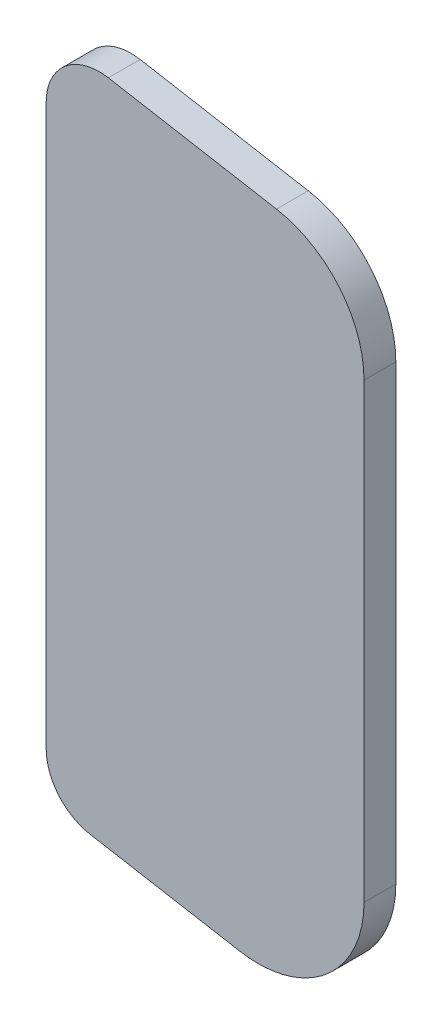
from build123d import *

# Parameters (mm, degrees)
EXTRUSION1_DEPTH = 3


with BuildPart() as part:
    # Esquisse1 → Extrusion1 (new body)
    with BuildSketch(Plane.XY):
        with BuildLine():
            Line((-10.781678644, 17.270229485), (5.086562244, 14.47223048))
            ThreePointArc((5.086562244, 14.47223048), (11.010524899, 11.052029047), (13.350080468, 4.62415295))
            Line((13.350080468, 4.62415295), (13.350080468, -38.067314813))
            ThreePointArc((13.350080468, -38.067314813), (9.777956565, -45.727759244), (1.613598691, -47.915392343))
            Line((1.613598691, -47.915392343), (-12.518160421, -45.423581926))
            ThreePointArc((-12.518160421, -45.423581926), (-15.480141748, -43.71348121), (-16.649919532, -40.499543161))
            Line((-16.649919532, -40.499543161), (-16.649919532, 12.34619072))
            ThreePointArc((-16.649919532, 12.34619072), (-14.863857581, 16.176412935), (-10.781678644, 17.270229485))
        make_face()
    extrude(amount=EXTRUSION1_DEPTH)


solid = part.part
